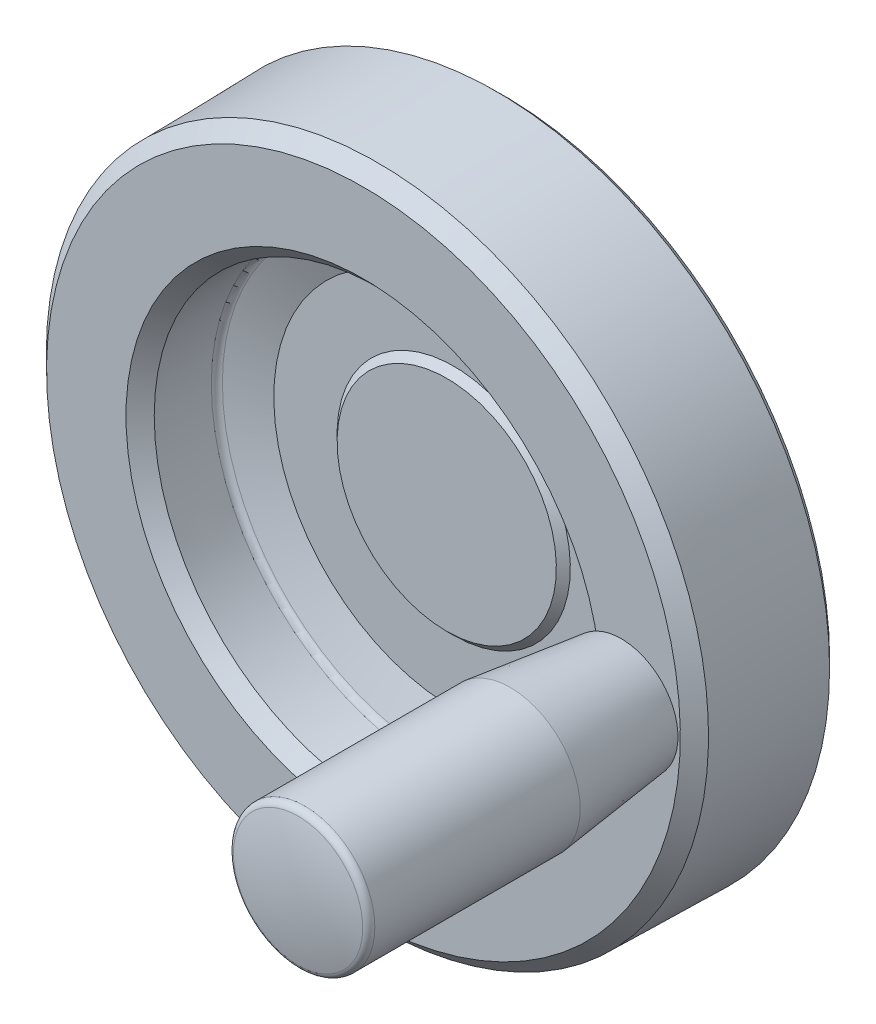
ISO-10303-21;
HEADER;
FILE_DESCRIPTION(('STEP AP214'),'2;1');
FILE_NAME('part.step','',(''),(''),'','','');
FILE_SCHEMA(('AUTOMOTIVE_DESIGN { 1 0 10303 214 1 1 1 1 }'));
ENDSEC;
DATA;
#1=APPLICATION_CONTEXT('core data for automotive mechanical design processes');
#2=APPLICATION_PROTOCOL_DEFINITION('international standard','automotive_design',2000,#1);
#3=PRODUCT_CONTEXT('',#1,'mechanical');
#4=PRODUCT('Part','Part','',(#3));
#5=PRODUCT_RELATED_PRODUCT_CATEGORY('part','',(#4));
#6=PRODUCT_DEFINITION_FORMATION('','',#4);
#7=PRODUCT_DEFINITION_CONTEXT('part definition',#1,'design');
#8=PRODUCT_DEFINITION('design','',#6,#7);
#9=PRODUCT_DEFINITION_SHAPE('','',#8);
#10=(LENGTH_UNIT() NAMED_UNIT(*) SI_UNIT(.MILLI.,.METRE.));
#11=(NAMED_UNIT(*) PLANE_ANGLE_UNIT() SI_UNIT($,.RADIAN.));
#12=(NAMED_UNIT(*) SI_UNIT($,.STERADIAN.) SOLID_ANGLE_UNIT());
#13=UNCERTAINTY_MEASURE_WITH_UNIT(LENGTH_MEASURE(1.E-05),#10,'distance_accuracy_value','');
#14=(GEOMETRIC_REPRESENTATION_CONTEXT(3) GLOBAL_UNCERTAINTY_ASSIGNED_CONTEXT((#13)) GLOBAL_UNIT_ASSIGNED_CONTEXT((#10,
#11,#12)) REPRESENTATION_CONTEXT('',''));
#15=CARTESIAN_POINT('',(0.,0.,0.));
#16=DIRECTION('',(0.,0.,1.));
#17=DIRECTION('',(1.,0.,0.));
#18=AXIS2_PLACEMENT_3D('',#15,#16,#17);
#19=CARTESIAN_POINT('',(39.,0.,33.613499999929));
#20=DIRECTION('',(0.,0.,1.));
#21=DIRECTION('',(-1.,0.,0.));
#22=AXIS2_PLACEMENT_3D('',#19,#20,#21);
#23=CONICAL_SURFACE('',#22,2.99999999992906,0.785398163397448);
#24=CARTESIAN_POINT('',(39.,0.,33.));
#25=DIRECTION('',(0.,0.,1.));
#26=DIRECTION('',(-1.,0.,0.));
#27=AXIS2_PLACEMENT_3D('',#24,#25,#26);
#28=CIRCLE('',#27,2.38650000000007);
#29=CARTESIAN_POINT('',(36.6134999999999,0.,33.));
#30=VERTEX_POINT('',#29);
#31=EDGE_CURVE('E177',#30,#30,#28,.T.);
#32=ORIENTED_EDGE('',*,*,#31,.T.);
#33=EDGE_LOOP('',(#32));
#34=FACE_BOUND('',#33,.T.);
#35=CARTESIAN_POINT('',(39.,0.,33.072));
#36=DIRECTION('',(0.,0.,1.));
#37=DIRECTION('',(0.,1.,0.));
#38=AXIS2_PLACEMENT_3D('',#35,#36,#37);
#39=CIRCLE('',#38,2.4585);
#40=CARTESIAN_POINT('',(39.,2.4585,33.072));
#41=VERTEX_POINT('',#40);
#42=EDGE_CURVE('E9',#41,#41,#39,.T.);
#43=ORIENTED_EDGE('',*,*,#42,.F.);
#44=EDGE_LOOP('',(#43));
#45=FACE_BOUND('',#44,.T.);
#46=ADVANCED_FACE('F15',(#34,#45),#23,.T.);
#47=CARTESIAN_POINT('',(39.,0.,33.));
#48=DIRECTION('',(0.,0.,1.));
#49=DIRECTION('',(-1.,0.,0.));
#50=AXIS2_PLACEMENT_3D('',#47,#48,#49);
#51=PLANE('',#50);
#52=DIRECTION('',(0.866025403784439,-0.5,0.));
#53=VECTOR('',#52,1.);
#54=CARTESIAN_POINT('',(40.5,0.866025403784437,33.));
#55=LINE('',#54,#53);
#56=CARTESIAN_POINT('',(39.,1.73205080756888,33.));
#57=VERTEX_POINT('',#56);
#58=CARTESIAN_POINT('',(40.5,0.866025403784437,33.));
#59=VERTEX_POINT('',#58);
#60=EDGE_CURVE('E183',#57,#59,#55,.T.);
#61=ORIENTED_EDGE('',*,*,#60,.F.);
#62=DIRECTION('',(0.866025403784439,0.5,0.));
#63=VECTOR('',#62,1.);
#64=CARTESIAN_POINT('',(39.,1.73205080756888,33.));
#65=LINE('',#64,#63);
#66=CARTESIAN_POINT('',(37.5,0.866025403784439,33.));
#67=VERTEX_POINT('',#66);
#68=EDGE_CURVE('E113',#67,#57,#65,.T.);
#69=ORIENTED_EDGE('',*,*,#68,.F.);
#70=DIRECTION('',(0.,-1.,0.));
#71=VECTOR('',#70,1.);
#72=CARTESIAN_POINT('',(37.5,0.866025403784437,33.));
#73=LINE('',#72,#71);
#74=CARTESIAN_POINT('',(37.5,-0.86602540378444,33.));
#75=VERTEX_POINT('',#74);
#76=EDGE_CURVE('E151',#75,#67,#73,.F.);
#77=ORIENTED_EDGE('',*,*,#76,.F.);
#78=DIRECTION('',(-0.866025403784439,0.5,0.));
#79=VECTOR('',#78,1.);
#80=CARTESIAN_POINT('',(37.5,-0.866025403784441,33.));
#81=LINE('',#80,#79);
#82=CARTESIAN_POINT('',(39.,-1.73205080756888,33.));
#83=VERTEX_POINT('',#82);
#84=EDGE_CURVE('E144',#83,#75,#81,.T.);
#85=ORIENTED_EDGE('',*,*,#84,.F.);
#86=DIRECTION('',(-0.866025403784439,-0.5,0.));
#87=VECTOR('',#86,1.);
#88=CARTESIAN_POINT('',(39.,-1.73205080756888,33.));
#89=LINE('',#88,#87);
#90=CARTESIAN_POINT('',(40.5,-0.866025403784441,33.));
#91=VERTEX_POINT('',#90);
#92=EDGE_CURVE('E143',#91,#83,#89,.T.);
#93=ORIENTED_EDGE('',*,*,#92,.F.);
#94=DIRECTION('',(0.,-1.,0.));
#95=VECTOR('',#94,1.);
#96=CARTESIAN_POINT('',(40.5,0.,33.));
#97=LINE('',#96,#95);
#98=EDGE_CURVE('E180',#59,#91,#97,.T.);
#99=ORIENTED_EDGE('',*,*,#98,.F.);
#100=EDGE_LOOP('',(#61,#69,#77,#85,#93,#99));
#101=FACE_BOUND('',#100,.T.);
#102=ORIENTED_EDGE('',*,*,#31,.F.);
#103=EDGE_LOOP('',(#102));
#104=FACE_BOUND('',#103,.T.);
#105=ADVANCED_FACE('F233',(#101,#104),#51,.F.);
#106=CARTESIAN_POINT('',(40.5,0.866025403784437,36.25));
#107=DIRECTION('',(-0.5,-0.866025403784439,0.));
#108=DIRECTION('',(0.866025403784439,-0.5,0.));
#109=AXIS2_PLACEMENT_3D('',#106,#107,#108);
#110=PLANE('',#109);
#111=DIRECTION('',(0.866025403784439,-0.5,0.));
#112=VECTOR('',#111,1.);
#113=CARTESIAN_POINT('',(40.5,0.866025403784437,36.25));
#114=LINE('',#113,#112);
#115=CARTESIAN_POINT('',(39.7500000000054,1.29903810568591,36.2499999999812));
#116=VERTEX_POINT('',#115);
#117=CARTESIAN_POINT('',(39.,1.73205080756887,36.25));
#118=VERTEX_POINT('',#117);
#119=EDGE_CURVE('E111',#116,#118,#114,.F.);
#120=ORIENTED_EDGE('',*,*,#119,.T.);
#121=DIRECTION('',(0.,0.,1.));
#122=VECTOR('',#121,1.);
#123=CARTESIAN_POINT('',(39.,1.73205080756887,36.25));
#124=LINE('',#123,#122);
#125=EDGE_CURVE('E128',#118,#57,#124,.F.);
#126=ORIENTED_EDGE('',*,*,#125,.T.);
#127=ORIENTED_EDGE('',*,*,#60,.T.);
#128=DIRECTION('',(0.,0.,-1.));
#129=VECTOR('',#128,1.);
#130=CARTESIAN_POINT('',(40.5,0.866025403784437,36.25));
#131=LINE('',#130,#129);
#132=CARTESIAN_POINT('',(40.5,0.866025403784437,36.25));
#133=VERTEX_POINT('',#132);
#134=EDGE_CURVE('E217',#133,#59,#131,.T.);
#135=ORIENTED_EDGE('',*,*,#134,.F.);
#136=DIRECTION('',(0.866025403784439,-0.5,0.));
#137=VECTOR('',#136,1.);
#138=CARTESIAN_POINT('',(40.5,0.866025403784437,36.25));
#139=LINE('',#138,#137);
#140=EDGE_CURVE('E210',#133,#116,#139,.F.);
#141=ORIENTED_EDGE('',*,*,#140,.T.);
#142=EDGE_LOOP('',(#120,#126,#127,#135,#141));
#143=FACE_BOUND('',#142,.T.);
#144=ADVANCED_FACE('F245',(#143),#110,.T.);
#145=CARTESIAN_POINT('',(39.,1.73205080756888,36.25));
#146=DIRECTION('',(0.5,-0.866025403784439,0.));
#147=DIRECTION('',(0.866025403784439,0.5,0.));
#148=AXIS2_PLACEMENT_3D('',#145,#146,#147);
#149=PLANE('',#148);
#150=DIRECTION('',(0.866025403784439,0.5,0.));
#151=VECTOR('',#150,1.);
#152=CARTESIAN_POINT('',(39.,1.73205080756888,36.25));
#153=LINE('',#152,#151);
#154=CARTESIAN_POINT('',(38.2499999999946,1.29903810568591,36.2499999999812));
#155=VERTEX_POINT('',#154);
#156=CARTESIAN_POINT('',(37.5,0.866025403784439,36.25));
#157=VERTEX_POINT('',#156);
#158=EDGE_CURVE('E117',#155,#157,#153,.F.);
#159=ORIENTED_EDGE('',*,*,#158,.T.);
#160=DIRECTION('',(0.,0.,1.));
#161=VECTOR('',#160,1.);
#162=CARTESIAN_POINT('',(37.5,0.86602540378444,36.25));
#163=LINE('',#162,#161);
#164=EDGE_CURVE('E123',#157,#67,#163,.F.);
#165=ORIENTED_EDGE('',*,*,#164,.T.);
#166=ORIENTED_EDGE('',*,*,#68,.T.);
#167=ORIENTED_EDGE('',*,*,#125,.F.);
#168=DIRECTION('',(0.866025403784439,0.5,0.));
#169=VECTOR('',#168,1.);
#170=CARTESIAN_POINT('',(39.,1.73205080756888,36.25));
#171=LINE('',#170,#169);
#172=EDGE_CURVE('E108',#118,#155,#171,.F.);
#173=ORIENTED_EDGE('',*,*,#172,.T.);
#174=EDGE_LOOP('',(#159,#165,#166,#167,#173));
#175=FACE_BOUND('',#174,.T.);
#176=ADVANCED_FACE('F125',(#175),#149,.T.);
#177=CARTESIAN_POINT('',(37.5,0.866025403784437,36.25));
#178=DIRECTION('',(1.,0.,0.));
#179=DIRECTION('',(0.,0.,1.));
#180=AXIS2_PLACEMENT_3D('',#177,#178,#179);
#181=PLANE('',#180);
#182=DIRECTION('',(0.,-1.,0.));
#183=VECTOR('',#182,1.);
#184=CARTESIAN_POINT('',(37.5,0.866025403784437,36.25));
#185=LINE('',#184,#183);
#186=CARTESIAN_POINT('',(37.4999999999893,0.,36.2499999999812));
#187=VERTEX_POINT('',#186);
#188=CARTESIAN_POINT('',(37.5,-0.86602540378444,36.25));
#189=VERTEX_POINT('',#188);
#190=EDGE_CURVE('E147',#187,#189,#185,.T.);
#191=ORIENTED_EDGE('',*,*,#190,.T.);
#192=DIRECTION('',(0.,0.,1.));
#193=VECTOR('',#192,1.);
#194=CARTESIAN_POINT('',(37.5,-0.86602540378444,36.25));
#195=LINE('',#194,#193);
#196=EDGE_CURVE('E146',#75,#189,#195,.T.);
#197=ORIENTED_EDGE('',*,*,#196,.F.);
#198=ORIENTED_EDGE('',*,*,#76,.T.);
#199=ORIENTED_EDGE('',*,*,#164,.F.);
#200=DIRECTION('',(0.,-1.,0.));
#201=VECTOR('',#200,1.);
#202=CARTESIAN_POINT('',(37.5,0.866025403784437,36.25));
#203=LINE('',#202,#201);
#204=EDGE_CURVE('E119',#157,#187,#203,.T.);
#205=ORIENTED_EDGE('',*,*,#204,.T.);
#206=EDGE_LOOP('',(#191,#197,#198,#199,#205));
#207=FACE_BOUND('',#206,.T.);
#208=ADVANCED_FACE('F246',(#207),#181,.T.);
#209=CARTESIAN_POINT('',(37.5,-0.866025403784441,36.25));
#210=DIRECTION('',(0.5,0.866025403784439,0.));
#211=DIRECTION('',(-0.866025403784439,0.5,0.));
#212=AXIS2_PLACEMENT_3D('',#209,#210,#211);
#213=PLANE('',#212);
#214=DIRECTION('',(0.866025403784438,-0.5,0.));
#215=VECTOR('',#214,1.);
#216=CARTESIAN_POINT('',(38.25,-1.29903810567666,36.25));
#217=LINE('',#216,#215);
#218=CARTESIAN_POINT('',(38.2499999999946,-1.29903810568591,36.2499999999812));
#219=VERTEX_POINT('',#218);
#220=CARTESIAN_POINT('',(39.,-1.73205080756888,36.25));
#221=VERTEX_POINT('',#220);
#222=EDGE_CURVE('E103',#219,#221,#217,.T.);
#223=ORIENTED_EDGE('',*,*,#222,.T.);
#224=DIRECTION('',(0.,0.,1.));
#225=VECTOR('',#224,1.);
#226=CARTESIAN_POINT('',(39.,-1.73205080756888,36.25));
#227=LINE('',#226,#225);
#228=EDGE_CURVE('E138',#83,#221,#227,.T.);
#229=ORIENTED_EDGE('',*,*,#228,.F.);
#230=ORIENTED_EDGE('',*,*,#84,.T.);
#231=ORIENTED_EDGE('',*,*,#196,.T.);
#232=DIRECTION('',(-0.866025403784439,0.5,0.));
#233=VECTOR('',#232,1.);
#234=CARTESIAN_POINT('',(37.5,-0.866025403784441,36.25));
#235=LINE('',#234,#233);
#236=EDGE_CURVE('E140',#189,#219,#235,.F.);
#237=ORIENTED_EDGE('',*,*,#236,.T.);
#238=EDGE_LOOP('',(#223,#229,#230,#231,#237));
#239=FACE_BOUND('',#238,.T.);
#240=ADVANCED_FACE('F237',(#239),#213,.T.);
#241=CARTESIAN_POINT('',(39.,-1.73205080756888,36.25));
#242=DIRECTION('',(-0.5,0.866025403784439,0.));
#243=DIRECTION('',(-0.866025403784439,-0.5,0.));
#244=AXIS2_PLACEMENT_3D('',#241,#242,#243);
#245=PLANE('',#244);
#246=DIRECTION('',(0.866025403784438,0.5,0.));
#247=VECTOR('',#246,1.);
#248=CARTESIAN_POINT('',(39.75,-1.29903810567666,36.25));
#249=LINE('',#248,#247);
#250=CARTESIAN_POINT('',(39.7500000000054,-1.29903810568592,36.2499999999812));
#251=VERTEX_POINT('',#250);
#252=CARTESIAN_POINT('',(40.5,-0.866025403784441,36.25));
#253=VERTEX_POINT('',#252);
#254=EDGE_CURVE('E137',#251,#253,#249,.T.);
#255=ORIENTED_EDGE('',*,*,#254,.T.);
#256=DIRECTION('',(0.,0.,-1.));
#257=VECTOR('',#256,1.);
#258=CARTESIAN_POINT('',(40.5,-0.866025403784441,36.25));
#259=LINE('',#258,#257);
#260=EDGE_CURVE('E212',#91,#253,#259,.F.);
#261=ORIENTED_EDGE('',*,*,#260,.F.);
#262=ORIENTED_EDGE('',*,*,#92,.T.);
#263=ORIENTED_EDGE('',*,*,#228,.T.);
#264=DIRECTION('',(-0.866025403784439,-0.5,0.));
#265=VECTOR('',#264,1.);
#266=CARTESIAN_POINT('',(39.,-1.73205080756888,36.25));
#267=LINE('',#266,#265);
#268=EDGE_CURVE('E134',#221,#251,#267,.F.);
#269=ORIENTED_EDGE('',*,*,#268,.T.);
#270=EDGE_LOOP('',(#255,#261,#262,#263,#269));
#271=FACE_BOUND('',#270,.T.);
#272=ADVANCED_FACE('F235',(#271),#245,.T.);
#273=CARTESIAN_POINT('',(40.5,-0.866025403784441,36.25));
#274=DIRECTION('',(-1.,0.,0.));
#275=DIRECTION('',(0.,0.,-1.));
#276=AXIS2_PLACEMENT_3D('',#273,#274,#275);
#277=PLANE('',#276);
#278=DIRECTION('',(0.,-1.,0.));
#279=VECTOR('',#278,1.);
#280=CARTESIAN_POINT('',(40.5,-0.866025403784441,36.25));
#281=LINE('',#280,#279);
#282=CARTESIAN_POINT('',(40.5000000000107,0.,36.2499999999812));
#283=VERTEX_POINT('',#282);
#284=EDGE_CURVE('E227',#283,#133,#281,.F.);
#285=ORIENTED_EDGE('',*,*,#284,.T.);
#286=ORIENTED_EDGE('',*,*,#134,.T.);
#287=ORIENTED_EDGE('',*,*,#98,.T.);
#288=ORIENTED_EDGE('',*,*,#260,.T.);
#289=DIRECTION('',(0.,-1.,0.));
#290=VECTOR('',#289,1.);
#291=CARTESIAN_POINT('',(40.5,-0.866025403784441,36.25));
#292=LINE('',#291,#290);
#293=EDGE_CURVE('E203',#253,#283,#292,.F.);
#294=ORIENTED_EDGE('',*,*,#293,.T.);
#295=EDGE_LOOP('',(#285,#286,#287,#288,#294));
#296=FACE_BOUND('',#295,.T.);
#297=ADVANCED_FACE('F231',(#296),#277,.T.);
#298=CARTESIAN_POINT('',(39.,0.,36.25));
#299=DIRECTION('',(0.,0.,1.));
#300=DIRECTION('',(-1.,0.,0.));
#301=AXIS2_PLACEMENT_3D('',#298,#299,#300);
#302=PLANE('',#301);
#303=ORIENTED_EDGE('',*,*,#172,.F.);
#304=ORIENTED_EDGE('',*,*,#119,.F.);
#305=CARTESIAN_POINT('',(39.,0.,36.2499999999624));
#306=DIRECTION('',(0.,0.,-1.));
#307=DIRECTION('',(0.,1.,0.));
#308=AXIS2_PLACEMENT_3D('',#305,#306,#307);
#309=CIRCLE('',#308,1.50000000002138);
#310=EDGE_CURVE('E96',#155,#116,#309,.T.);
#311=ORIENTED_EDGE('',*,*,#310,.F.);
#312=EDGE_LOOP('',(#303,#304,#311));
#313=FACE_BOUND('',#312,.T.);
#314=ADVANCED_FACE('F106',(#313),#302,.F.);
#315=CARTESIAN_POINT('',(39.,0.,36.25));
#316=DIRECTION('',(0.,0.,1.));
#317=DIRECTION('',(-1.,0.,0.));
#318=AXIS2_PLACEMENT_3D('',#315,#316,#317);
#319=PLANE('',#318);
#320=ORIENTED_EDGE('',*,*,#140,.F.);
#321=ORIENTED_EDGE('',*,*,#284,.F.);
#322=CARTESIAN_POINT('',(39.,0.,36.2499999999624));
#323=DIRECTION('',(0.,0.,-1.));
#324=DIRECTION('',(0.,1.,0.));
#325=AXIS2_PLACEMENT_3D('',#322,#323,#324);
#326=CIRCLE('',#325,1.50000000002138);
#327=EDGE_CURVE('E181',#116,#283,#326,.T.);
#328=ORIENTED_EDGE('',*,*,#327,.F.);
#329=EDGE_LOOP('',(#320,#321,#328));
#330=FACE_BOUND('',#329,.T.);
#331=ADVANCED_FACE('F251',(#330),#319,.F.);
#332=CARTESIAN_POINT('',(39.,0.,36.25));
#333=DIRECTION('',(0.,0.,1.));
#334=DIRECTION('',(-1.,0.,0.));
#335=AXIS2_PLACEMENT_3D('',#332,#333,#334);
#336=PLANE('',#335);
#337=ORIENTED_EDGE('',*,*,#204,.F.);
#338=ORIENTED_EDGE('',*,*,#158,.F.);
#339=CARTESIAN_POINT('',(39.,0.,36.2499999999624));
#340=DIRECTION('',(0.,0.,-1.));
#341=DIRECTION('',(0.,1.,0.));
#342=AXIS2_PLACEMENT_3D('',#339,#340,#341);
#343=CIRCLE('',#342,1.50000000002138);
#344=EDGE_CURVE('E19',#155,#187,#343,.F.);
#345=ORIENTED_EDGE('',*,*,#344,.T.);
#346=EDGE_LOOP('',(#337,#338,#345));
#347=FACE_BOUND('',#346,.T.);
#348=ADVANCED_FACE('F118',(#347),#336,.F.);
#349=CARTESIAN_POINT('',(39.,0.,36.25));
#350=DIRECTION('',(0.,0.,1.));
#351=DIRECTION('',(-1.,0.,0.));
#352=AXIS2_PLACEMENT_3D('',#349,#350,#351);
#353=PLANE('',#352);
#354=ORIENTED_EDGE('',*,*,#236,.F.);
#355=ORIENTED_EDGE('',*,*,#190,.F.);
#356=CARTESIAN_POINT('',(39.,0.,36.2499999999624));
#357=DIRECTION('',(0.,0.,-1.));
#358=DIRECTION('',(0.,1.,0.));
#359=AXIS2_PLACEMENT_3D('',#356,#357,#358);
#360=CIRCLE('',#359,1.50000000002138);
#361=EDGE_CURVE('E99',#187,#219,#360,.F.);
#362=ORIENTED_EDGE('',*,*,#361,.T.);
#363=EDGE_LOOP('',(#354,#355,#362));
#364=FACE_BOUND('',#363,.T.);
#365=ADVANCED_FACE('F17',(#364),#353,.F.);
#366=CARTESIAN_POINT('',(39.,0.,36.25));
#367=DIRECTION('',(0.,0.,1.));
#368=DIRECTION('',(-1.,0.,0.));
#369=AXIS2_PLACEMENT_3D('',#366,#367,#368);
#370=PLANE('',#369);
#371=ORIENTED_EDGE('',*,*,#268,.F.);
#372=ORIENTED_EDGE('',*,*,#222,.F.);
#373=CARTESIAN_POINT('',(39.,0.,36.2499999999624));
#374=DIRECTION('',(0.,0.,-1.));
#375=DIRECTION('',(0.,1.,0.));
#376=AXIS2_PLACEMENT_3D('',#373,#374,#375);
#377=CIRCLE('',#376,1.50000000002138);
#378=EDGE_CURVE('E114',#219,#251,#377,.F.);
#379=ORIENTED_EDGE('',*,*,#378,.T.);
#380=EDGE_LOOP('',(#371,#372,#379));
#381=FACE_BOUND('',#380,.T.);
#382=ADVANCED_FACE('F193',(#381),#370,.F.);
#383=CARTESIAN_POINT('',(39.,0.,36.25));
#384=DIRECTION('',(0.,0.,1.));
#385=DIRECTION('',(-1.,0.,0.));
#386=AXIS2_PLACEMENT_3D('',#383,#384,#385);
#387=PLANE('',#386);
#388=ORIENTED_EDGE('',*,*,#293,.F.);
#389=ORIENTED_EDGE('',*,*,#254,.F.);
#390=CARTESIAN_POINT('',(39.,0.,36.2499999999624));
#391=DIRECTION('',(0.,0.,-1.));
#392=DIRECTION('',(0.,1.,0.));
#393=AXIS2_PLACEMENT_3D('',#390,#391,#392);
#394=CIRCLE('',#393,1.50000000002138);
#395=EDGE_CURVE('E184',#283,#251,#394,.T.);
#396=ORIENTED_EDGE('',*,*,#395,.F.);
#397=EDGE_LOOP('',(#388,#389,#396));
#398=FACE_BOUND('',#397,.T.);
#399=ADVANCED_FACE('F201',(#398),#387,.F.);
#400=CARTESIAN_POINT('',(39.,0.,36.2500000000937));
#401=DIRECTION('',(0.,0.,-1.));
#402=DIRECTION('',(0.,1.,0.));
#403=AXIS2_PLACEMENT_3D('',#400,#401,#402);
#404=CONICAL_SURFACE('',#403,1.499999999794,1.04719755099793);
#405=CARTESIAN_POINT('',(38.9999999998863,0.,37.116025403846));
#406=VERTEX_POINT('',#405);
#407=VERTEX_LOOP('',#406);
#408=FACE_BOUND('',#407,.T.);
#409=ORIENTED_EDGE('',*,*,#378,.F.);
#410=ORIENTED_EDGE('',*,*,#361,.F.);
#411=ORIENTED_EDGE('',*,*,#344,.F.);
#412=ORIENTED_EDGE('',*,*,#310,.T.);
#413=ORIENTED_EDGE('',*,*,#327,.T.);
#414=ORIENTED_EDGE('',*,*,#395,.T.);
#415=EDGE_LOOP('',(#409,#410,#411,#412,#413,#414));
#416=FACE_BOUND('',#415,.T.);
#417=ADVANCED_FACE('F95',(#408,#416),#404,.F.);
#418=CARTESIAN_POINT('',(39.,0.,96.));
#419=DIRECTION('',(0.,0.,-1.));
#420=DIRECTION('',(1.,0.,0.));
#421=AXIS2_PLACEMENT_3D('',#418,#419,#420);
#422=CYLINDRICAL_SURFACE('',#421,3.9);
#423=CARTESIAN_POINT('',(39.,0.,46.));
#424=DIRECTION('',(0.,0.,-1.));
#425=DIRECTION('',(1.,0.,0.));
#426=AXIS2_PLACEMENT_3D('',#423,#424,#425);
#427=CIRCLE('',#426,3.9);
#428=CARTESIAN_POINT('',(35.58024773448,1.87491184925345,46.));
#429=VERTEX_POINT('',#428);
#430=CARTESIAN_POINT('',(35.58024773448,-1.87491184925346,46.));
#431=VERTEX_POINT('',#430);
#432=EDGE_CURVE('E168',#429,#431,#427,.F.);
#433=ORIENTED_EDGE('',*,*,#432,.T.);
#434=CARTESIAN_POINT('',(39.,0.,46.));
#435=DIRECTION('',(0.,0.,-1.));
#436=DIRECTION('',(-1.,0.,0.));
#437=AXIS2_PLACEMENT_3D('',#434,#435,#436);
#438=CIRCLE('',#437,3.9);
#439=EDGE_CURVE('E298',#429,#431,#438,.T.);
#440=ORIENTED_EDGE('',*,*,#439,.F.);
#441=EDGE_LOOP('',(#433,#440));
#442=FACE_BOUND('',#441,.T.);
#443=CARTESIAN_POINT('',(39.,0.,46.3));
#444=DIRECTION('',(0.,0.,-1.));
#445=DIRECTION('',(1.,0.,0.));
#446=AXIS2_PLACEMENT_3D('',#443,#444,#445);
#447=CIRCLE('',#446,3.9);
#448=CARTESIAN_POINT('',(42.9,0.,46.3));
#449=VERTEX_POINT('',#448);
#450=EDGE_CURVE('E165',#449,#449,#447,.T.);
#451=ORIENTED_EDGE('',*,*,#450,.T.);
#452=EDGE_LOOP('',(#451));
#453=FACE_BOUND('',#452,.T.);
#454=ADVANCED_FACE('F485',(#442,#453),#422,.T.);
#455=CARTESIAN_POINT('',(39.,0.,46.));
#456=DIRECTION('',(0.,0.,1.));
#457=DIRECTION('',(-1.,0.,0.));
#458=AXIS2_PLACEMENT_3D('',#455,#456,#457);
#459=PLANE('',#458);
#460=ORIENTED_EDGE('',*,*,#432,.F.);
#461=CARTESIAN_POINT('',(0.,0.,46.));
#462=DIRECTION('',(0.,0.,1.));
#463=DIRECTION('',(1.,0.,0.));
#464=AXIS2_PLACEMENT_3D('',#461,#462,#463);
#465=CIRCLE('',#464,35.6296130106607);
#466=EDGE_CURVE('E34',#431,#429,#465,.T.);
#467=ORIENTED_EDGE('',*,*,#466,.F.);
#468=EDGE_LOOP('',(#460,#467));
#469=FACE_BOUND('',#468,.T.);
#470=ADVANCED_FACE('F274',(#469),#459,.F.);
#471=CARTESIAN_POINT('',(39.,-3.9,46.3));
#472=DIRECTION('',(0.,0.,1.));
#473=DIRECTION('',(-1.,0.,0.));
#474=AXIS2_PLACEMENT_3D('',#471,#472,#473);
#475=PLANE('',#474);
#476=ORIENTED_EDGE('',*,*,#450,.F.);
#477=EDGE_LOOP('',(#476));
#478=FACE_BOUND('',#477,.T.);
#479=CARTESIAN_POINT('',(39.,0.,46.3));
#480=DIRECTION('',(0.,0.,1.));
#481=DIRECTION('',(-1.,0.,0.));
#482=AXIS2_PLACEMENT_3D('',#479,#480,#481);
#483=CIRCLE('',#482,8.5);
#484=CARTESIAN_POINT('',(30.5,0.,46.3));
#485=VERTEX_POINT('',#484);
#486=EDGE_CURVE('E158',#485,#485,#483,.T.);
#487=ORIENTED_EDGE('',*,*,#486,.F.);
#488=EDGE_LOOP('',(#487));
#489=FACE_BOUND('',#488,.T.);
#490=ADVANCED_FACE('F277',(#478,#489),#475,.F.);
#491=CARTESIAN_POINT('',(39.,0.,62.9666666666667));
#492=DIRECTION('',(0.,0.,1.));
#493=DIRECTION('',(-1.,0.,0.));
#494=AXIS2_PLACEMENT_3D('',#491,#492,#493);
#495=CONICAL_SURFACE('',#494,10.5,0.119428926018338);
#496=ORIENTED_EDGE('',*,*,#486,.T.);
#497=EDGE_LOOP('',(#496));
#498=FACE_BOUND('',#497,.T.);
#499=CARTESIAN_POINT('',(39.,0.,62.9666666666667));
#500=DIRECTION('',(0.,0.,-1.));
#501=DIRECTION('',(1.,0.,0.));
#502=AXIS2_PLACEMENT_3D('',#499,#500,#501);
#503=CIRCLE('',#502,10.5);
#504=CARTESIAN_POINT('',(49.5,0.,62.9666666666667));
#505=VERTEX_POINT('',#504);
#506=EDGE_CURVE('E290',#505,#505,#503,.F.);
#507=ORIENTED_EDGE('',*,*,#506,.F.);
#508=EDGE_LOOP('',(#507));
#509=FACE_BOUND('',#508,.T.);
#510=ADVANCED_FACE('F272',(#498,#509),#495,.T.);
#511=CARTESIAN_POINT('',(39.,0.,96.));
#512=DIRECTION('',(0.,0.,-1.));
#513=DIRECTION('',(1.,0.,0.));
#514=AXIS2_PLACEMENT_3D('',#511,#512,#513);
#515=CYLINDRICAL_SURFACE('',#514,10.5);
#516=ORIENTED_EDGE('',*,*,#506,.T.);
#517=EDGE_LOOP('',(#516));
#518=FACE_BOUND('',#517,.T.);
#519=CARTESIAN_POINT('',(39.,0.,93.7885461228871));
#520=DIRECTION('',(0.,0.,-1.));
#521=DIRECTION('',(1.,0.,0.));
#522=AXIS2_PLACEMENT_3D('',#519,#520,#521);
#523=CIRCLE('',#522,10.5);
#524=CARTESIAN_POINT('',(49.5,0.,93.7885461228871));
#525=VERTEX_POINT('',#524);
#526=EDGE_CURVE('E161',#525,#525,#523,.T.);
#527=ORIENTED_EDGE('',*,*,#526,.T.);
#528=EDGE_LOOP('',(#527));
#529=FACE_BOUND('',#528,.T.);
#530=ADVANCED_FACE('F268',(#518,#529),#515,.T.);
#531=CARTESIAN_POINT('',(39.,0.,93.7885461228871));
#532=DIRECTION('',(0.,0.,1.));
#533=DIRECTION('',(-1.,0.,0.));
#534=AXIS2_PLACEMENT_3D('',#531,#532,#533);
#535=TOROIDAL_SURFACE('',#534,9.45,1.05);
#536=CARTESIAN_POINT('',(39.,0.,94.8072962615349));
#537=DIRECTION('',(0.,0.,1.));
#538=DIRECTION('',(-1.,0.,0.));
#539=AXIS2_PLACEMENT_3D('',#536,#537,#538);
#540=CIRCLE('',#539,9.7042600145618);
#541=CARTESIAN_POINT('',(29.2957399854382,0.,94.8072962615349));
#542=VERTEX_POINT('',#541);
#543=EDGE_CURVE('E162',#542,#542,#540,.F.);
#544=ORIENTED_EDGE('',*,*,#543,.T.);
#545=EDGE_LOOP('',(#544));
#546=FACE_BOUND('',#545,.T.);
#547=ORIENTED_EDGE('',*,*,#526,.F.);
#548=EDGE_LOOP('',(#547));
#549=FACE_BOUND('',#548,.T.);
#550=ADVANCED_FACE('F271',(#546,#549),#535,.T.);
#551=CARTESIAN_POINT('',(39.,0.,55.925));
#552=DIRECTION('',(0.,1.,0.));
#553=DIRECTION('',(-1.,0.,0.));
#554=AXIS2_PLACEMENT_3D('',#551,#552,#553);
#555=SPHERICAL_SURFACE('',#554,40.0749999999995);
#556=ORIENTED_EDGE('',*,*,#543,.F.);
#557=EDGE_LOOP('',(#556));
#558=FACE_BOUND('',#557,.T.);
#559=ADVANCED_FACE('F281',(#558),#555,.T.);
#560=CARTESIAN_POINT('',(39.,0.,25.));
#561=DIRECTION('',(0.,0.,1.));
#562=DIRECTION('',(0.,1.,0.));
#563=AXIS2_PLACEMENT_3D('',#560,#561,#562);
#564=CYLINDRICAL_SURFACE('',#563,2.4585);
#565=ORIENTED_EDGE('',*,*,#42,.T.);
#566=EDGE_LOOP('',(#565));
#567=FACE_BOUND('',#566,.T.);
#568=CARTESIAN_POINT('',(39.,0.,25.5414999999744));
#569=DIRECTION('',(0.,0.,-1.));
#570=DIRECTION('',(0.,-1.,0.));
#571=AXIS2_PLACEMENT_3D('',#568,#569,#570);
#572=CIRCLE('',#571,2.45850000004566);
#573=CARTESIAN_POINT('',(39.,-2.45850000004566,25.5414999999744));
#574=VERTEX_POINT('',#573);
#575=EDGE_CURVE('E807',#574,#574,#572,.T.);
#576=ORIENTED_EDGE('',*,*,#575,.T.);
#577=EDGE_LOOP('',(#576));
#578=FACE_BOUND('',#577,.T.);
#579=ADVANCED_FACE('F419',(#567,#578),#564,.F.);
#580=CARTESIAN_POINT('',(39.,0.,25.0000000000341));
#581=DIRECTION('',(0.,0.,-1.));
#582=DIRECTION('',(-1.,0.,0.));
#583=AXIS2_PLACEMENT_3D('',#580,#581,#582);
#584=CONICAL_SURFACE('',#583,2.99999999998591,0.785398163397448);
#585=ORIENTED_EDGE('',*,*,#575,.F.);
#586=EDGE_LOOP('',(#585));
#587=FACE_BOUND('',#586,.T.);
#588=CARTESIAN_POINT('',(39.,0.,25.0000000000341));
#589=DIRECTION('',(0.,0.,-1.));
#590=DIRECTION('',(-1.,0.,0.));
#591=AXIS2_PLACEMENT_3D('',#588,#589,#590);
#592=CIRCLE('',#591,2.99999999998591);
#593=CARTESIAN_POINT('',(36.0000000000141,0.,25.0000000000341));
#594=VERTEX_POINT('',#593);
#595=EDGE_CURVE('E324',#594,#594,#592,.T.);
#596=ORIENTED_EDGE('',*,*,#595,.T.);
#597=EDGE_LOOP('',(#596));
#598=FACE_BOUND('',#597,.T.);
#599=ADVANCED_FACE('F609',(#587,#598),#584,.F.);
#600=CARTESIAN_POINT('',(-48.9683278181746,0.,25.));
#601=DIRECTION('',(0.,0.,1.));
#602=DIRECTION('',(1.,0.,0.));
#603=AXIS2_PLACEMENT_3D('',#600,#601,#602);
#604=PLANE('',#603);
#605=CARTESIAN_POINT('',(0.,0.,25.));
#606=DIRECTION('',(0.,0.,1.));
#607=DIRECTION('',(1.,0.,0.));
#608=AXIS2_PLACEMENT_3D('',#605,#606,#607);
#609=CIRCLE('',#608,48.9683278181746);
#610=CARTESIAN_POINT('',(48.9683278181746,0.,25.));
#611=VERTEX_POINT('',#610);
#612=EDGE_CURVE('E334',#611,#611,#609,.T.);
#613=ORIENTED_EDGE('',*,*,#612,.F.);
#614=EDGE_LOOP('',(#613));
#615=FACE_BOUND('',#614,.T.);
#616=ORIENTED_EDGE('',*,*,#595,.F.);
#617=EDGE_LOOP('',(#616));
#618=FACE_BOUND('',#617,.T.);
#619=CARTESIAN_POINT('',(0.,0.,25.));
#620=DIRECTION('',(0.,0.,1.));
#621=DIRECTION('',(1.,0.,0.));
#622=AXIS2_PLACEMENT_3D('',#619,#620,#621);
#623=CIRCLE('',#622,33.3333333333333);
#624=CARTESIAN_POINT('',(33.3333333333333,0.,25.));
#625=VERTEX_POINT('',#624);
#626=EDGE_CURVE('E321',#625,#625,#623,.F.);
#627=ORIENTED_EDGE('',*,*,#626,.F.);
#628=EDGE_LOOP('',(#627));
#629=FACE_BOUND('',#628,.T.);
#630=ADVANCED_FACE('F618',(#615,#618,#629),#604,.F.);
#631=CARTESIAN_POINT('',(-35.6296130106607,0.,46.));
#632=DIRECTION('',(0.,0.,-1.));
#633=DIRECTION('',(-1.,0.,0.));
#634=AXIS2_PLACEMENT_3D('',#631,#632,#633);
#635=PLANE('',#634);
#636=EDGE_CURVE('E331',#429,#431,#465,.T.);
#637=ORIENTED_EDGE('',*,*,#636,.F.);
#638=ORIENTED_EDGE('',*,*,#439,.T.);
#639=EDGE_LOOP('',(#637,#638));
#640=FACE_BOUND('',#639,.T.);
#641=CARTESIAN_POINT('',(0.,0.,46.));
#642=DIRECTION('',(0.,0.,-1.));
#643=DIRECTION('',(0.,-1.,0.));
#644=AXIS2_PLACEMENT_3D('',#641,#642,#643);
#645=CIRCLE('',#644,47.5517714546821);
#646=CARTESIAN_POINT('',(0.,-47.5517714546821,46.));
#647=VERTEX_POINT('',#646);
#648=EDGE_CURVE('E337',#647,#647,#645,.T.);
#649=ORIENTED_EDGE('',*,*,#648,.F.);
#650=EDGE_LOOP('',(#649));
#651=FACE_BOUND('',#650,.T.);
#652=ADVANCED_FACE('F628',(#640,#651),#635,.F.);
#653=CARTESIAN_POINT('',(0.,0.,46.));
#654=DIRECTION('',(0.,0.,1.));
#655=DIRECTION('',(1.,0.,0.));
#656=AXIS2_PLACEMENT_3D('',#653,#654,#655);
#657=CONICAL_SURFACE('',#656,35.6296130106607,0.794124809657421);
#658=CARTESIAN_POINT('',(0.,0.,43.9003198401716));
#659=DIRECTION('',(0.,0.,1.));
#660=DIRECTION('',(1.,0.,0.));
#661=AXIS2_PLACEMENT_3D('',#658,#659,#660);
#662=CIRCLE('',#661,33.4929629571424);
#663=CARTESIAN_POINT('',(33.4929629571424,0.,43.9003198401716));
#664=VERTEX_POINT('',#663);
#665=EDGE_CURVE('E325',#664,#664,#662,.T.);
#666=ORIENTED_EDGE('',*,*,#665,.F.);
#667=EDGE_LOOP('',(#666));
#668=FACE_BOUND('',#667,.T.);
#669=ORIENTED_EDGE('',*,*,#636,.T.);
#670=ORIENTED_EDGE('',*,*,#466,.T.);
#671=EDGE_LOOP('',(#669,#670));
#672=FACE_BOUND('',#671,.T.);
#673=ADVANCED_FACE('F638',(#668,#672),#657,.F.);
#674=CARTESIAN_POINT('',(0.,0.,43.9003198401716));
#675=DIRECTION('',(0.,0.,-1.));
#676=DIRECTION('',(0.,-1.,0.));
#677=AXIS2_PLACEMENT_3D('',#674,#675,#676);
#678=CONICAL_SURFACE('',#677,49.6884215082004,0.794124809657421);
#679=ORIENTED_EDGE('',*,*,#648,.T.);
#680=EDGE_LOOP('',(#679));
#681=FACE_BOUND('',#680,.T.);
#682=CARTESIAN_POINT('',(0.,0.,43.9003198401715));
#683=DIRECTION('',(0.,0.,-1.));
#684=DIRECTION('',(-1.,0.,0.));
#685=AXIS2_PLACEMENT_3D('',#682,#683,#684);
#686=CIRCLE('',#685,49.6884215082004);
#687=CARTESIAN_POINT('',(-49.6884215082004,0.,43.9003198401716));
#688=VERTEX_POINT('',#687);
#689=EDGE_CURVE('E300',#688,#688,#686,.T.);
#690=ORIENTED_EDGE('',*,*,#689,.F.);
#691=EDGE_LOOP('',(#690));
#692=FACE_BOUND('',#691,.T.);
#693=ADVANCED_FACE('F648',(#681,#692),#678,.T.);
#694=CARTESIAN_POINT('',(0.,0.,43.9003198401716));
#695=DIRECTION('',(0.,0.,1.));
#696=DIRECTION('',(1.,0.,0.));
#697=AXIS2_PLACEMENT_3D('',#694,#695,#696);
#698=CONICAL_SURFACE('',#697,33.4929629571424,0.0174532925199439);
#699=CARTESIAN_POINT('',(0.,0.,35.4766799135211));
#700=DIRECTION('',(0.,0.,1.));
#701=DIRECTION('',(1.,0.,0.));
#702=AXIS2_PLACEMENT_3D('',#699,#700,#701);
#703=CIRCLE('',#702,33.3459277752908);
#704=CARTESIAN_POINT('',(33.3459277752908,0.,35.4766799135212));
#705=VERTEX_POINT('',#704);
#706=EDGE_CURVE('E794',#705,#705,#703,.T.);
#707=ORIENTED_EDGE('',*,*,#706,.F.);
#708=EDGE_LOOP('',(#707));
#709=FACE_BOUND('',#708,.T.);
#710=ORIENTED_EDGE('',*,*,#665,.T.);
#711=EDGE_LOOP('',(#710));
#712=FACE_BOUND('',#711,.T.);
#713=ADVANCED_FACE('F658',(#709,#712),#698,.F.);
#714=CARTESIAN_POINT('',(0.,0.,26.0498400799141));
#715=DIRECTION('',(0.,0.,-1.));
#716=DIRECTION('',(-1.,0.,0.));
#717=AXIS2_PLACEMENT_3D('',#714,#715,#716);
#718=CONICAL_SURFACE('',#717,50.0000027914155,0.0174532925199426);
#719=ORIENTED_EDGE('',*,*,#689,.T.);
#720=EDGE_LOOP('',(#719));
#721=FACE_BOUND('',#720,.T.);
#722=CARTESIAN_POINT('',(0.,0.,26.0498400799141));
#723=DIRECTION('',(0.,0.,-1.));
#724=DIRECTION('',(-1.,0.,0.));
#725=AXIS2_PLACEMENT_3D('',#722,#723,#724);
#726=CIRCLE('',#725,50.0000027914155);
#727=CARTESIAN_POINT('',(-50.0000027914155,0.,26.049840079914));
#728=VERTEX_POINT('',#727);
#729=EDGE_CURVE('E340',#728,#728,#726,.F.);
#730=ORIENTED_EDGE('',*,*,#729,.T.);
#731=EDGE_LOOP('',(#730));
#732=FACE_BOUND('',#731,.T.);
#733=ADVANCED_FACE('F668',(#721,#732),#718,.T.);
#734=CARTESIAN_POINT('',(0.,0.,35.4950049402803));
#735=DIRECTION('',(0.,0.,-1.));
#736=DIRECTION('',(-1.,0.,0.));
#737=AXIS2_PLACEMENT_3D('',#734,#735,#736);
#738=TOROIDAL_SURFACE('',#737,32.2960876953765,1.05);
#739=CARTESIAN_POINT('',(0.,0.,34.5083276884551));
#740=DIRECTION('',(0.,0.,-1.));
#741=DIRECTION('',(-1.,0.,0.));
#742=AXIS2_PLACEMENT_3D('',#739,#740,#741);
#743=CIRCLE('',#742,32.6552088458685);
#744=CARTESIAN_POINT('',(-32.6552088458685,0.,34.5083276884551));
#745=VERTEX_POINT('',#744);
#746=EDGE_CURVE('E781',#745,#745,#743,.F.);
#747=ORIENTED_EDGE('',*,*,#746,.F.);
#748=EDGE_LOOP('',(#747));
#749=FACE_BOUND('',#748,.T.);
#750=ORIENTED_EDGE('',*,*,#706,.T.);
#751=EDGE_LOOP('',(#750));
#752=FACE_BOUND('',#751,.T.);
#753=ADVANCED_FACE('F678',(#749,#752),#738,.F.);
#754=CARTESIAN_POINT('',(0.,0.,26.0498400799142));
#755=DIRECTION('',(0.,0.,1.));
#756=DIRECTION('',(1.,0.,0.));
#757=AXIS2_PLACEMENT_3D('',#754,#755,#756);
#758=CONICAL_SURFACE('',#757,50.0000027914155,0.776671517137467);
#759=ORIENTED_EDGE('',*,*,#729,.F.);
#760=EDGE_LOOP('',(#759));
#761=FACE_BOUND('',#760,.T.);
#762=ORIENTED_EDGE('',*,*,#612,.T.);
#763=EDGE_LOOP('',(#762));
#764=FACE_BOUND('',#763,.T.);
#765=ADVANCED_FACE('F688',(#761,#764),#758,.T.);
#766=CARTESIAN_POINT('',(0.,0.,34.5083276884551));
#767=DIRECTION('',(0.,0.,1.));
#768=DIRECTION('',(0.,1.,0.));
#769=AXIS2_PLACEMENT_3D('',#766,#767,#768);
#770=CONICAL_SURFACE('',#769,32.6552088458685,1.22173047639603);
#771=CARTESIAN_POINT('',(0.,0.,32.45));
#772=DIRECTION('',(0.,0.,1.));
#773=DIRECTION('',(0.,1.,0.));
#774=AXIS2_PLACEMENT_3D('',#771,#772,#773);
#775=CIRCLE('',#774,27.);
#776=CARTESIAN_POINT('',(0.,27.,32.45));
#777=VERTEX_POINT('',#776);
#778=EDGE_CURVE('E317',#777,#777,#775,.T.);
#779=ORIENTED_EDGE('',*,*,#778,.F.);
#780=EDGE_LOOP('',(#779));
#781=FACE_BOUND('',#780,.T.);
#782=ORIENTED_EDGE('',*,*,#746,.T.);
#783=EDGE_LOOP('',(#782));
#784=FACE_BOUND('',#783,.T.);
#785=ADVANCED_FACE('F361',(#781,#784),#770,.F.);
#786=CARTESIAN_POINT('',(0.,0.,0.));
#787=DIRECTION('',(0.,0.,1.));
#788=DIRECTION('',(1.,0.,0.));
#789=AXIS2_PLACEMENT_3D('',#786,#787,#788);
#790=CYLINDRICAL_SURFACE('',#789,33.3333333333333);
#791=ORIENTED_EDGE('',*,*,#626,.T.);
#792=EDGE_LOOP('',(#791));
#793=FACE_BOUND('',#792,.T.);
#794=CARTESIAN_POINT('',(0.,0.,26.7813466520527));
#795=DIRECTION('',(0.,0.,1.));
#796=DIRECTION('',(1.,0.,0.));
#797=AXIS2_PLACEMENT_3D('',#794,#795,#796);
#798=CIRCLE('',#797,33.3333333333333);
#799=CARTESIAN_POINT('',(33.3333333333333,0.,26.7813466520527));
#800=VERTEX_POINT('',#799);
#801=EDGE_CURVE('E797',#800,#800,#798,.F.);
#802=ORIENTED_EDGE('',*,*,#801,.F.);
#803=EDGE_LOOP('',(#802));
#804=FACE_BOUND('',#803,.T.);
#805=ADVANCED_FACE('F367',(#793,#804),#790,.F.);
#806=CARTESIAN_POINT('',(-17.5,0.,32.45));
#807=DIRECTION('',(0.,0.,-1.));
#808=DIRECTION('',(-1.,0.,0.));
#809=AXIS2_PLACEMENT_3D('',#806,#807,#808);
#810=PLANE('',#809);
#811=CARTESIAN_POINT('',(0.,0.,32.45));
#812=DIRECTION('',(0.,0.,-1.));
#813=DIRECTION('',(0.,-1.,0.));
#814=AXIS2_PLACEMENT_3D('',#811,#812,#813);
#815=CIRCLE('',#814,17.5);
#816=CARTESIAN_POINT('',(0.,-17.5,32.45));
#817=VERTEX_POINT('',#816);
#818=EDGE_CURVE('E313',#817,#817,#815,.F.);
#819=ORIENTED_EDGE('',*,*,#818,.F.);
#820=EDGE_LOOP('',(#819));
#821=FACE_BOUND('',#820,.T.);
#822=ORIENTED_EDGE('',*,*,#778,.T.);
#823=EDGE_LOOP('',(#822));
#824=FACE_BOUND('',#823,.T.);
#825=ADVANCED_FACE('F363',(#821,#824),#810,.F.);
#826=CARTESIAN_POINT('',(0.,0.,26.7813466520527));
#827=DIRECTION('',(0.,0.,-1.));
#828=DIRECTION('',(-1.,0.,0.));
#829=AXIS2_PLACEMENT_3D('',#826,#827,#828);
#830=TOROIDAL_SURFACE('',#829,32.2833333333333,1.05);
#831=ORIENTED_EDGE('',*,*,#801,.T.);
#832=EDGE_LOOP('',(#831));
#833=FACE_BOUND('',#832,.T.);
#834=CARTESIAN_POINT('',(0.,0.,27.6906733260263));
#835=DIRECTION('',(0.,0.,-1.));
#836=DIRECTION('',(-1.,0.,0.));
#837=AXIS2_PLACEMENT_3D('',#834,#835,#836);
#838=CIRCLE('',#837,31.7583333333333);
#839=CARTESIAN_POINT('',(-31.7583333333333,0.,27.6906733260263));
#840=VERTEX_POINT('',#839);
#841=EDGE_CURVE('E784',#840,#840,#838,.T.);
#842=ORIENTED_EDGE('',*,*,#841,.F.);
#843=EDGE_LOOP('',(#842));
#844=FACE_BOUND('',#843,.T.);
#845=ADVANCED_FACE('F366',(#833,#844),#830,.F.);
#846=CARTESIAN_POINT('',(0.,0.,32.45));
#847=DIRECTION('',(0.,0.,-1.));
#848=DIRECTION('',(0.,-1.,0.));
#849=AXIS2_PLACEMENT_3D('',#846,#847,#848);
#850=CONICAL_SURFACE('',#849,17.5,0.785398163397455);
#851=CARTESIAN_POINT('',(0.,0.,33.5));
#852=DIRECTION('',(0.,0.,-1.));
#853=DIRECTION('',(0.,-1.,0.));
#854=AXIS2_PLACEMENT_3D('',#851,#852,#853);
#855=CIRCLE('',#854,16.45);
#856=CARTESIAN_POINT('',(0.,-16.45,33.5));
#857=VERTEX_POINT('',#856);
#858=EDGE_CURVE('E307',#857,#857,#855,.T.);
#859=ORIENTED_EDGE('',*,*,#858,.T.);
#860=EDGE_LOOP('',(#859));
#861=FACE_BOUND('',#860,.T.);
#862=ORIENTED_EDGE('',*,*,#818,.T.);
#863=EDGE_LOOP('',(#862));
#864=FACE_BOUND('',#863,.T.);
#865=ADVANCED_FACE('F373',(#861,#864),#850,.T.);
#866=CARTESIAN_POINT('',(0.,0.,27.6906733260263));
#867=DIRECTION('',(0.,0.,1.));
#868=DIRECTION('',(1.,0.,0.));
#869=AXIS2_PLACEMENT_3D('',#866,#867,#868);
#870=CONICAL_SURFACE('',#869,31.7583333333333,1.0471975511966);
#871=ORIENTED_EDGE('',*,*,#841,.T.);
#872=EDGE_LOOP('',(#871));
#873=FACE_BOUND('',#872,.T.);
#874=CARTESIAN_POINT('',(0.,0.,20.9164301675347));
#875=DIRECTION('',(0.,0.,1.));
#876=DIRECTION('',(1.,0.,0.));
#877=AXIS2_PLACEMENT_3D('',#874,#875,#876);
#878=CIRCLE('',#877,20.025);
#879=CARTESIAN_POINT('',(20.025,0.,20.9164301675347));
#880=VERTEX_POINT('',#879);
#881=EDGE_CURVE('E320',#880,#880,#878,.T.);
#882=ORIENTED_EDGE('',*,*,#881,.T.);
#883=EDGE_LOOP('',(#882));
#884=FACE_BOUND('',#883,.T.);
#885=ADVANCED_FACE('F376',(#873,#884),#870,.T.);
#886=CARTESIAN_POINT('',(0.,0.,33.5));
#887=DIRECTION('',(0.,0.,-1.));
#888=DIRECTION('',(-1.,0.,0.));
#889=AXIS2_PLACEMENT_3D('',#886,#887,#888);
#890=PLANE('',#889);
#891=ORIENTED_EDGE('',*,*,#858,.F.);
#892=EDGE_LOOP('',(#891));
#893=FACE_BOUND('',#892,.T.);
#894=ADVANCED_FACE('F359',(#893),#890,.F.);
#895=CARTESIAN_POINT('',(0.,0.,20.0071034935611));
#896=DIRECTION('',(0.,0.,-1.));
#897=DIRECTION('',(-1.,0.,0.));
#898=AXIS2_PLACEMENT_3D('',#895,#896,#897);
#899=TOROIDAL_SURFACE('',#898,20.55,1.05);
#900=ORIENTED_EDGE('',*,*,#881,.F.);
#901=EDGE_LOOP('',(#900));
#902=FACE_BOUND('',#901,.T.);
#903=CARTESIAN_POINT('',(0.,0.,20.0071034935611));
#904=DIRECTION('',(0.,0.,-1.));
#905=DIRECTION('',(-1.,0.,0.));
#906=AXIS2_PLACEMENT_3D('',#903,#904,#905);
#907=CIRCLE('',#906,19.5);
#908=CARTESIAN_POINT('',(-19.5,0.,20.0071034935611));
#909=VERTEX_POINT('',#908);
#910=EDGE_CURVE('E316',#909,#909,#907,.T.);
#911=ORIENTED_EDGE('',*,*,#910,.F.);
#912=EDGE_LOOP('',(#911));
#913=FACE_BOUND('',#912,.T.);
#914=ADVANCED_FACE('F354',(#902,#913),#899,.F.);
#915=CARTESIAN_POINT('',(0.,0.,0.));
#916=DIRECTION('',(0.,0.,1.));
#917=DIRECTION('',(1.,0.,0.));
#918=AXIS2_PLACEMENT_3D('',#915,#916,#917);
#919=CYLINDRICAL_SURFACE('',#918,19.5);
#920=ORIENTED_EDGE('',*,*,#910,.T.);
#921=EDGE_LOOP('',(#920));
#922=FACE_BOUND('',#921,.T.);
#923=CARTESIAN_POINT('',(0.,0.,12.));
#924=DIRECTION('',(0.,0.,1.));
#925=DIRECTION('',(1.,0.,0.));
#926=AXIS2_PLACEMENT_3D('',#923,#924,#925);
#927=CIRCLE('',#926,19.5);
#928=CARTESIAN_POINT('',(19.5,0.,12.));
#929=VERTEX_POINT('',#928);
#930=EDGE_CURVE('E310',#929,#929,#927,.T.);
#931=ORIENTED_EDGE('',*,*,#930,.T.);
#932=EDGE_LOOP('',(#931));
#933=FACE_BOUND('',#932,.T.);
#934=ADVANCED_FACE('F358',(#922,#933),#919,.T.);
#935=CARTESIAN_POINT('',(-19.5,0.,12.));
#936=DIRECTION('',(0.,0.,1.));
#937=DIRECTION('',(1.,0.,0.));
#938=AXIS2_PLACEMENT_3D('',#935,#936,#937);
#939=PLANE('',#938);
#940=ORIENTED_EDGE('',*,*,#930,.F.);
#941=EDGE_LOOP('',(#940));
#942=FACE_BOUND('',#941,.T.);
#943=CARTESIAN_POINT('',(0.,0.,12.));
#944=DIRECTION('',(0.,0.,1.));
#945=DIRECTION('',(1.,0.,0.));
#946=AXIS2_PLACEMENT_3D('',#943,#944,#945);
#947=CIRCLE('',#946,12.);
#948=CARTESIAN_POINT('',(12.,0.,12.));
#949=VERTEX_POINT('',#948);
#950=EDGE_CURVE('E304',#949,#949,#947,.F.);
#951=ORIENTED_EDGE('',*,*,#950,.F.);
#952=EDGE_LOOP('',(#951));
#953=FACE_BOUND('',#952,.T.);
#954=ADVANCED_FACE('F371',(#942,#953),#939,.F.);
#955=CARTESIAN_POINT('',(0.,0.,0.));
#956=DIRECTION('',(0.,0.,1.));
#957=DIRECTION('',(1.,0.,0.));
#958=AXIS2_PLACEMENT_3D('',#955,#956,#957);
#959=CYLINDRICAL_SURFACE('',#958,12.);
#960=ORIENTED_EDGE('',*,*,#950,.T.);
#961=EDGE_LOOP('',(#960));
#962=FACE_BOUND('',#961,.T.);
#963=CARTESIAN_POINT('',(0.,0.,0.6));
#964=DIRECTION('',(0.,0.,1.));
#965=DIRECTION('',(1.,0.,0.));
#966=AXIS2_PLACEMENT_3D('',#963,#964,#965);
#967=CIRCLE('',#966,12.);
#968=CARTESIAN_POINT('',(12.,0.,0.6));
#969=VERTEX_POINT('',#968);
#970=EDGE_CURVE('E303',#969,#969,#967,.T.);
#971=ORIENTED_EDGE('',*,*,#970,.T.);
#972=EDGE_LOOP('',(#971));
#973=FACE_BOUND('',#972,.T.);
#974=ADVANCED_FACE('F262',(#962,#973),#959,.T.);
#975=CARTESIAN_POINT('',(0.,0.,0.6));
#976=DIRECTION('',(0.,0.,1.));
#977=DIRECTION('',(1.,0.,0.));
#978=AXIS2_PLACEMENT_3D('',#975,#976,#977);
#979=CONICAL_SURFACE('',#978,12.,0.785398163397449);
#980=ORIENTED_EDGE('',*,*,#970,.F.);
#981=EDGE_LOOP('',(#980));
#982=FACE_BOUND('',#981,.T.);
#983=CARTESIAN_POINT('',(0.,0.,0.));
#984=DIRECTION('',(0.,0.,1.));
#985=DIRECTION('',(1.,0.,0.));
#986=AXIS2_PLACEMENT_3D('',#983,#984,#985);
#987=CIRCLE('',#986,11.4);
#988=CARTESIAN_POINT('',(11.4,0.,0.));
#989=VERTEX_POINT('',#988);
#990=EDGE_CURVE('E294',#989,#989,#987,.T.);
#991=ORIENTED_EDGE('',*,*,#990,.T.);
#992=EDGE_LOOP('',(#991));
#993=FACE_BOUND('',#992,.T.);
#994=ADVANCED_FACE('F255',(#982,#993),#979,.T.);
#995=CARTESIAN_POINT('',(-11.4,0.,0.));
#996=DIRECTION('',(0.,0.,1.));
#997=DIRECTION('',(1.,0.,0.));
#998=AXIS2_PLACEMENT_3D('',#995,#996,#997);
#999=PLANE('',#998);
#1000=ORIENTED_EDGE('',*,*,#990,.F.);
#1001=EDGE_LOOP('',(#1000));
#1002=FACE_BOUND('',#1001,.T.);
#1003=ADVANCED_FACE('F253',(#1002),#999,.F.);
#1004=CLOSED_SHELL('',(#46,#105,#144,#176,#208,#240,#272,#297,#314,#331,#348,#365,#382,#399,
#417,#454,#470,#490,#510,#530,#550,#559,#579,#599,#630,#652,#673,#693,#713,#733,#753,#765,#785,
#805,#825,#845,#865,#885,#894,#914,#934,#954,#974,#994,#1003));
#1005=CARTESIAN_POINT('',(39.,0.,45.4584999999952));
#1006=DIRECTION('',(0.,0.,1.));
#1007=DIRECTION('',(0.,1.,0.));
#1008=AXIS2_PLACEMENT_3D('',#1005,#1006,#1007);
#1009=CIRCLE('',#1008,2.45849999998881);
#1010=CARTESIAN_POINT('',(39.,2.45849999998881,45.4584999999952));
#1011=VERTEX_POINT('',#1010);
#1012=EDGE_CURVE('E812',#1011,#1011,#1009,.T.);
#1013=ORIENTED_EDGE('',*,*,#1012,.T.);
#1014=EDGE_LOOP('',(#1013));
#1015=FACE_BOUND('',#1014,.T.);
#1016=CARTESIAN_POINT('',(39.,0.,43.4));
#1017=DIRECTION('',(0.,0.,-1.));
#1018=DIRECTION('',(0.,-1.,0.));
#1019=AXIS2_PLACEMENT_3D('',#1016,#1017,#1018);
#1020=CIRCLE('',#1019,2.4585);
#1021=CARTESIAN_POINT('',(39.,-2.4585,43.4));
#1022=VERTEX_POINT('',#1021);
#1023=EDGE_CURVE('E26',#1022,#1022,#1020,.F.);
#1024=ORIENTED_EDGE('',*,*,#1023,.F.);
#1025=EDGE_LOOP('',(#1024));
#1026=FACE_BOUND('',#1025,.T.);
#1027=ADVANCED_FACE('F413',(#1015,#1026),#564,.F.);
#1028=CARTESIAN_POINT('',(39.,0.,45.9999999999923));
#1029=DIRECTION('',(0.,0.,1.));
#1030=DIRECTION('',(0.,1.,0.));
#1031=AXIS2_PLACEMENT_3D('',#1028,#1029,#1030);
#1032=CONICAL_SURFACE('',#1031,2.99999999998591,0.785398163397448);
#1033=CARTESIAN_POINT('',(39.,0.,45.9999999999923));
#1034=DIRECTION('',(0.,0.,1.));
#1035=DIRECTION('',(0.,1.,0.));
#1036=AXIS2_PLACEMENT_3D('',#1033,#1034,#1035);
#1037=CIRCLE('',#1036,2.99999999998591);
#1038=CARTESIAN_POINT('',(39.,2.99999999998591,45.9999999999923));
#1039=VERTEX_POINT('',#1038);
#1040=EDGE_CURVE('E328',#1039,#1039,#1037,.T.);
#1041=ORIENTED_EDGE('',*,*,#1040,.T.);
#1042=EDGE_LOOP('',(#1041));
#1043=FACE_BOUND('',#1042,.T.);
#1044=ORIENTED_EDGE('',*,*,#1012,.F.);
#1045=EDGE_LOOP('',(#1044));
#1046=FACE_BOUND('',#1045,.T.);
#1047=ADVANCED_FACE('F416',(#1043,#1046),#1032,.F.);
#1048=CARTESIAN_POINT('',(39.,0.,58.));
#1049=DIRECTION('',(0.,0.,-1.));
#1050=DIRECTION('',(1.,0.,0.));
#1051=AXIS2_PLACEMENT_3D('',#1048,#1049,#1050);
#1052=CYLINDRICAL_SURFACE('',#1051,2.14785);
#1053=CARTESIAN_POINT('',(39.,0.,43.4));
#1054=DIRECTION('',(0.,0.,-1.));
#1055=DIRECTION('',(1.,0.,0.));
#1056=AXIS2_PLACEMENT_3D('',#1053,#1054,#1055);
#1057=CIRCLE('',#1056,2.14785);
#1058=CARTESIAN_POINT('',(41.14785,0.,43.4));
#1059=VERTEX_POINT('',#1058);
#1060=EDGE_CURVE('E174',#1059,#1059,#1057,.F.);
#1061=ORIENTED_EDGE('',*,*,#1060,.T.);
#1062=EDGE_LOOP('',(#1061));
#1063=FACE_BOUND('',#1062,.T.);
#1064=CARTESIAN_POINT('',(39.,0.,46.));
#1065=DIRECTION('',(0.,0.,-1.));
#1066=DIRECTION('',(1.,0.,0.));
#1067=AXIS2_PLACEMENT_3D('',#1064,#1065,#1066);
#1068=CIRCLE('',#1067,2.14785);
#1069=CARTESIAN_POINT('',(41.14785,0.,46.));
#1070=VERTEX_POINT('',#1069);
#1071=EDGE_CURVE('E171',#1070,#1070,#1068,.T.);
#1072=ORIENTED_EDGE('',*,*,#1071,.T.);
#1073=EDGE_LOOP('',(#1072));
#1074=FACE_BOUND('',#1073,.T.);
#1075=ADVANCED_FACE('F428',(#1063,#1074),#1052,.T.);
#1076=ORIENTED_EDGE('',*,*,#1071,.F.);
#1077=EDGE_LOOP('',(#1076));
#1078=FACE_BOUND('',#1077,.T.);
#1079=ORIENTED_EDGE('',*,*,#1040,.F.);
#1080=EDGE_LOOP('',(#1079));
#1081=FACE_BOUND('',#1080,.T.);
#1082=ADVANCED_FACE('F438',(#1078,#1081),#459,.F.);
#1083=CARTESIAN_POINT('',(39.,-3.,43.4));
#1084=DIRECTION('',(0.,0.,-1.));
#1085=DIRECTION('',(1.,0.,0.));
#1086=AXIS2_PLACEMENT_3D('',#1083,#1084,#1085);
#1087=PLANE('',#1086);
#1088=ORIENTED_EDGE('',*,*,#1060,.F.);
#1089=EDGE_LOOP('',(#1088));
#1090=FACE_BOUND('',#1089,.T.);
#1091=ORIENTED_EDGE('',*,*,#1023,.T.);
#1092=EDGE_LOOP('',(#1091));
#1093=FACE_BOUND('',#1092,.T.);
#1094=ADVANCED_FACE('F448',(#1090,#1093),#1087,.F.);
#1095=CLOSED_SHELL('',(#1027,#1047,#1075,#1082,#1094));
#1096=ORIENTED_CLOSED_SHELL('',*,#1095,.T.);
#1097=BREP_WITH_VOIDS('B1',#1004,(#1096));
#1098=ADVANCED_BREP_SHAPE_REPRESENTATION('',(#18,#1097),#14);
#1099=SHAPE_DEFINITION_REPRESENTATION(#9,#1098);
ENDSEC;
END-ISO-10303-21;
